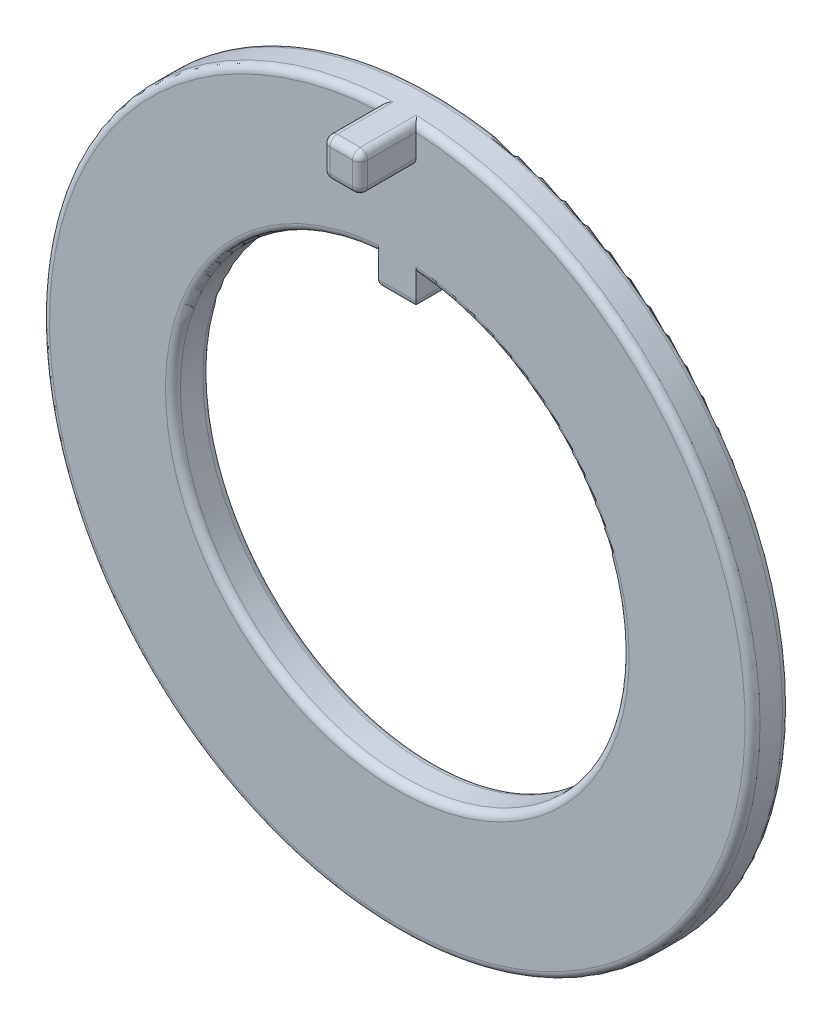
ISO-10303-21;
HEADER;
FILE_DESCRIPTION(('STEP AP214'),'2;1');
FILE_NAME('part.step','',(''),(''),'','','');
FILE_SCHEMA(('AUTOMOTIVE_DESIGN { 1 0 10303 214 1 1 1 1 }'));
ENDSEC;
DATA;
#1=APPLICATION_CONTEXT('core data for automotive mechanical design processes');
#2=APPLICATION_PROTOCOL_DEFINITION('international standard','automotive_design',2000,#1);
#3=PRODUCT_CONTEXT('',#1,'mechanical');
#4=PRODUCT('Part','Part','',(#3));
#5=PRODUCT_RELATED_PRODUCT_CATEGORY('part','',(#4));
#6=PRODUCT_DEFINITION_FORMATION('','',#4);
#7=PRODUCT_DEFINITION_CONTEXT('part definition',#1,'design');
#8=PRODUCT_DEFINITION('design','',#6,#7);
#9=PRODUCT_DEFINITION_SHAPE('','',#8);
#10=(LENGTH_UNIT() NAMED_UNIT(*) SI_UNIT(.MILLI.,.METRE.));
#11=(NAMED_UNIT(*) PLANE_ANGLE_UNIT() SI_UNIT($,.RADIAN.));
#12=(NAMED_UNIT(*) SI_UNIT($,.STERADIAN.) SOLID_ANGLE_UNIT());
#13=UNCERTAINTY_MEASURE_WITH_UNIT(LENGTH_MEASURE(1.E-05),#10,'distance_accuracy_value','');
#14=(GEOMETRIC_REPRESENTATION_CONTEXT(3) GLOBAL_UNCERTAINTY_ASSIGNED_CONTEXT((#13)) GLOBAL_UNIT_ASSIGNED_CONTEXT((#10,
#11,#12)) REPRESENTATION_CONTEXT('',''));
#15=CARTESIAN_POINT('',(0.,0.,0.));
#16=DIRECTION('',(0.,0.,1.));
#17=DIRECTION('',(1.,0.,0.));
#18=AXIS2_PLACEMENT_3D('',#15,#16,#17);
#19=CARTESIAN_POINT('',(0.,0.,1.));
#20=DIRECTION('',(0.,0.,1.));
#21=DIRECTION('',(1.,0.,0.));
#22=AXIS2_PLACEMENT_3D('',#19,#20,#21);
#23=PLANE('',#22);
#24=DIRECTION('',(0.,1.,0.));
#25=VECTOR('',#24,1.);
#26=CARTESIAN_POINT('',(-0.5,5.9791303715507,1.));
#27=LINE('',#26,#25);
#28=CARTESIAN_POINT('',(-0.5,5.3791303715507,1.));
#29=VERTEX_POINT('',#28);
#30=CARTESIAN_POINT('',(-0.5,6.17980582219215,1.));
#31=VERTEX_POINT('',#30);
#32=EDGE_CURVE('E500',#29,#31,#27,.T.);
#33=ORIENTED_EDGE('',*,*,#32,.F.);
#34=DIRECTION('',(-1.,0.,0.));
#35=VECTOR('',#34,1.);
#36=CARTESIAN_POINT('',(0.,5.3791303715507,1.));
#37=LINE('',#36,#35);
#38=CARTESIAN_POINT('',(0.5,5.3791303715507,1.));
#39=VERTEX_POINT('',#38);
#40=EDGE_CURVE('E43',#29,#39,#37,.F.);
#41=ORIENTED_EDGE('',*,*,#40,.T.);
#42=DIRECTION('',(0.,-1.,0.));
#43=VECTOR('',#42,1.);
#44=CARTESIAN_POINT('',(0.5,5.1791303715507,1.));
#45=LINE('',#44,#43);
#46=CARTESIAN_POINT('',(0.5,6.17980582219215,1.));
#47=VERTEX_POINT('',#46);
#48=EDGE_CURVE('E174',#47,#39,#45,.T.);
#49=ORIENTED_EDGE('',*,*,#48,.F.);
#50=CARTESIAN_POINT('',(0.,0.,1.));
#51=DIRECTION('',(0.,0.,1.));
#52=DIRECTION('',(1.,0.,0.));
#53=AXIS2_PLACEMENT_3D('',#50,#51,#52);
#54=CIRCLE('',#53,6.2);
#55=EDGE_CURVE('E205',#47,#31,#54,.F.);
#56=ORIENTED_EDGE('',*,*,#55,.T.);
#57=EDGE_LOOP('',(#33,#41,#49,#56));
#58=FACE_BOUND('',#57,.T.);
#59=DIRECTION('',(0.,-1.,0.));
#60=VECTOR('',#59,1.);
#61=CARTESIAN_POINT('',(-0.500000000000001,9.48683298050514,1.));
#62=LINE('',#61,#60);
#63=CARTESIAN_POINT('',(-0.500000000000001,9.28654941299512,1.));
#64=VERTEX_POINT('',#63);
#65=CARTESIAN_POINT('',(-0.5,8.68683298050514,1.));
#66=VERTEX_POINT('',#65);
#67=EDGE_CURVE('E388',#64,#66,#62,.T.);
#68=ORIENTED_EDGE('',*,*,#67,.F.);
#69=CARTESIAN_POINT('',(0.,0.,1.));
#70=DIRECTION('',(0.,0.,1.));
#71=DIRECTION('',(1.,0.,0.));
#72=AXIS2_PLACEMENT_3D('',#69,#70,#71);
#73=CIRCLE('',#72,9.3);
#74=CARTESIAN_POINT('',(0.5,9.28654941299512,1.));
#75=VERTEX_POINT('',#74);
#76=EDGE_CURVE('E484',#64,#75,#73,.T.);
#77=ORIENTED_EDGE('',*,*,#76,.T.);
#78=DIRECTION('',(0.,1.,0.));
#79=VECTOR('',#78,1.);
#80=CARTESIAN_POINT('',(0.5,8.48683298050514,1.));
#81=LINE('',#80,#79);
#82=CARTESIAN_POINT('',(0.5,8.68683298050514,1.));
#83=VERTEX_POINT('',#82);
#84=EDGE_CURVE('E489',#83,#75,#81,.T.);
#85=ORIENTED_EDGE('',*,*,#84,.F.);
#86=CARTESIAN_POINT('',(0.3,8.68683298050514,1.));
#87=DIRECTION('',(0.,0.,1.));
#88=DIRECTION('',(1.,0.,0.));
#89=AXIS2_PLACEMENT_3D('',#86,#87,#88);
#90=CIRCLE('',#89,0.2);
#91=CARTESIAN_POINT('',(0.299999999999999,8.48683298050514,1.));
#92=VERTEX_POINT('',#91);
#93=EDGE_CURVE('E483',#83,#92,#90,.F.);
#94=ORIENTED_EDGE('',*,*,#93,.T.);
#95=DIRECTION('',(1.,0.,0.));
#96=VECTOR('',#95,1.);
#97=CARTESIAN_POINT('',(-0.5,8.48683298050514,1.));
#98=LINE('',#97,#96);
#99=CARTESIAN_POINT('',(-0.300000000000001,8.48683298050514,1.));
#100=VERTEX_POINT('',#99);
#101=EDGE_CURVE('E492',#100,#92,#98,.T.);
#102=ORIENTED_EDGE('',*,*,#101,.F.);
#103=CARTESIAN_POINT('',(-0.3,8.68683298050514,1.));
#104=DIRECTION('',(0.,0.,1.));
#105=DIRECTION('',(1.,0.,0.));
#106=AXIS2_PLACEMENT_3D('',#103,#104,#105);
#107=CIRCLE('',#106,0.2);
#108=EDGE_CURVE('E476',#100,#66,#107,.F.);
#109=ORIENTED_EDGE('',*,*,#108,.T.);
#110=EDGE_LOOP('',(#68,#77,#85,#94,#102,#109));
#111=FACE_BOUND('',#110,.T.);
#112=ADVANCED_FACE('F34',(#58,#111),#23,.T.);
#113=CARTESIAN_POINT('',(0.,0.,0.));
#114=DIRECTION('',(0.,0.,1.));
#115=DIRECTION('',(1.,0.,0.));
#116=AXIS2_PLACEMENT_3D('',#113,#114,#115);
#117=PLANE('',#116);
#118=CARTESIAN_POINT('',(0.,0.,0.));
#119=DIRECTION('',(0.,0.,1.));
#120=DIRECTION('',(1.,0.,0.));
#121=AXIS2_PLACEMENT_3D('',#118,#119,#120);
#122=CIRCLE('',#121,9.3);
#123=CARTESIAN_POINT('',(9.3,0.,0.));
#124=VERTEX_POINT('',#123);
#125=EDGE_CURVE('E191',#124,#124,#122,.F.);
#126=ORIENTED_EDGE('',*,*,#125,.T.);
#127=EDGE_LOOP('',(#126));
#128=FACE_BOUND('',#127,.T.);
#129=DIRECTION('',(0.,-1.,0.));
#130=VECTOR('',#129,1.);
#131=CARTESIAN_POINT('',(0.5,5.1791303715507,0.));
#132=LINE('',#131,#130);
#133=CARTESIAN_POINT('',(0.5,6.17980582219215,0.));
#134=VERTEX_POINT('',#133);
#135=CARTESIAN_POINT('',(0.5,5.3791303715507,0.));
#136=VERTEX_POINT('',#135);
#137=EDGE_CURVE('E175',#134,#136,#132,.T.);
#138=ORIENTED_EDGE('',*,*,#137,.T.);
#139=DIRECTION('',(-1.,0.,0.));
#140=VECTOR('',#139,1.);
#141=CARTESIAN_POINT('',(-0.5,5.3791303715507,0.));
#142=LINE('',#141,#140);
#143=CARTESIAN_POINT('',(-0.5,5.3791303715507,0.));
#144=VERTEX_POINT('',#143);
#145=EDGE_CURVE('E173',#136,#144,#142,.T.);
#146=ORIENTED_EDGE('',*,*,#145,.T.);
#147=DIRECTION('',(0.,1.,0.));
#148=VECTOR('',#147,1.);
#149=CARTESIAN_POINT('',(-0.5,5.9791303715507,0.));
#150=LINE('',#149,#148);
#151=CARTESIAN_POINT('',(-0.5,6.17980582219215,0.));
#152=VERTEX_POINT('',#151);
#153=EDGE_CURVE('E166',#144,#152,#150,.T.);
#154=ORIENTED_EDGE('',*,*,#153,.T.);
#155=CARTESIAN_POINT('',(0.,0.,0.));
#156=DIRECTION('',(0.,0.,1.));
#157=DIRECTION('',(1.,0.,0.));
#158=AXIS2_PLACEMENT_3D('',#155,#156,#157);
#159=CIRCLE('',#158,6.2);
#160=EDGE_CURVE('E171',#152,#134,#159,.T.);
#161=ORIENTED_EDGE('',*,*,#160,.T.);
#162=EDGE_LOOP('',(#138,#146,#154,#161));
#163=FACE_BOUND('',#162,.T.);
#164=ADVANCED_FACE('F169',(#128,#163),#117,.F.);
#165=CARTESIAN_POINT('',(0.,0.,1.));
#166=DIRECTION('',(0.,0.,-1.));
#167=DIRECTION('',(-1.,0.,0.));
#168=AXIS2_PLACEMENT_3D('',#165,#166,#167);
#169=CYLINDRICAL_SURFACE('',#168,9.5);
#170=CARTESIAN_POINT('',(0.,0.,0.2));
#171=DIRECTION('',(0.,0.,1.));
#172=DIRECTION('',(1.,0.,0.));
#173=AXIS2_PLACEMENT_3D('',#170,#171,#172);
#174=CIRCLE('',#173,9.5);
#175=CARTESIAN_POINT('',(9.5,0.,0.2));
#176=VERTEX_POINT('',#175);
#177=EDGE_CURVE('E202',#176,#176,#174,.T.);
#178=ORIENTED_EDGE('',*,*,#177,.T.);
#179=EDGE_LOOP('',(#178));
#180=FACE_BOUND('',#179,.T.);
#181=DIRECTION('',(0.,0.,-1.));
#182=VECTOR('',#181,1.);
#183=CARTESIAN_POINT('',(-0.306451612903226,9.49505594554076,1.));
#184=LINE('',#183,#182);
#185=CARTESIAN_POINT('',(-0.306451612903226,9.49505594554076,0.8));
#186=VERTEX_POINT('',#185);
#187=CARTESIAN_POINT('',(-0.306451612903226,9.49505594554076,2.3));
#188=VERTEX_POINT('',#187);
#189=EDGE_CURVE('E339',#186,#188,#184,.F.);
#190=ORIENTED_EDGE('',*,*,#189,.T.);
#191=CARTESIAN_POINT('',(0.,0.,2.3));
#192=DIRECTION('',(0.,0.,1.));
#193=DIRECTION('',(1.,0.,0.));
#194=AXIS2_PLACEMENT_3D('',#191,#192,#193);
#195=CIRCLE('',#194,9.5);
#196=CARTESIAN_POINT('',(0.306451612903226,9.49505594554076,2.3));
#197=VERTEX_POINT('',#196);
#198=EDGE_CURVE('E342',#188,#197,#195,.F.);
#199=ORIENTED_EDGE('',*,*,#198,.T.);
#200=DIRECTION('',(0.,0.,-1.));
#201=VECTOR('',#200,1.);
#202=CARTESIAN_POINT('',(0.306451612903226,9.49505594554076,1.));
#203=LINE('',#202,#201);
#204=CARTESIAN_POINT('',(0.306451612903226,9.49505594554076,0.8));
#205=VERTEX_POINT('',#204);
#206=EDGE_CURVE('E347',#197,#205,#203,.T.);
#207=ORIENTED_EDGE('',*,*,#206,.T.);
#208=CARTESIAN_POINT('',(0.,0.,0.8));
#209=DIRECTION('',(0.,0.,1.));
#210=DIRECTION('',(1.,0.,0.));
#211=AXIS2_PLACEMENT_3D('',#208,#209,#210);
#212=CIRCLE('',#211,9.5);
#213=EDGE_CURVE('E299',#205,#186,#212,.F.);
#214=ORIENTED_EDGE('',*,*,#213,.T.);
#215=EDGE_LOOP('',(#190,#199,#207,#214));
#216=FACE_BOUND('',#215,.T.);
#217=ADVANCED_FACE('F325',(#180,#216),#169,.T.);
#218=CARTESIAN_POINT('',(0.,0.,1.));
#219=DIRECTION('',(0.,0.,-1.));
#220=DIRECTION('',(-1.,0.,0.));
#221=AXIS2_PLACEMENT_3D('',#218,#219,#220);
#222=CYLINDRICAL_SURFACE('',#221,6.);
#223=DIRECTION('',(0.,0.,-1.));
#224=VECTOR('',#223,1.);
#225=CARTESIAN_POINT('',(0.5,5.9791303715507,1.));
#226=LINE('',#225,#224);
#227=CARTESIAN_POINT('',(0.5,5.9791303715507,0.8));
#228=VERTEX_POINT('',#227);
#229=CARTESIAN_POINT('',(0.5,5.9791303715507,0.2));
#230=VERTEX_POINT('',#229);
#231=EDGE_CURVE('E197',#228,#230,#226,.T.);
#232=ORIENTED_EDGE('',*,*,#231,.T.);
#233=CARTESIAN_POINT('',(0.,0.,0.2));
#234=DIRECTION('',(0.,0.,1.));
#235=DIRECTION('',(1.,0.,0.));
#236=AXIS2_PLACEMENT_3D('',#233,#234,#235);
#237=CIRCLE('',#236,6.);
#238=CARTESIAN_POINT('',(-0.5,5.9791303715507,0.2));
#239=VERTEX_POINT('',#238);
#240=EDGE_CURVE('E194',#230,#239,#237,.F.);
#241=ORIENTED_EDGE('',*,*,#240,.T.);
#242=DIRECTION('',(0.,0.,-1.));
#243=VECTOR('',#242,1.);
#244=CARTESIAN_POINT('',(-0.5,5.9791303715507,1.));
#245=LINE('',#244,#243);
#246=CARTESIAN_POINT('',(-0.5,5.9791303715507,0.8));
#247=VERTEX_POINT('',#246);
#248=EDGE_CURVE('E182',#247,#239,#245,.T.);
#249=ORIENTED_EDGE('',*,*,#248,.F.);
#250=CARTESIAN_POINT('',(0.,0.,0.8));
#251=DIRECTION('',(0.,0.,1.));
#252=DIRECTION('',(1.,0.,0.));
#253=AXIS2_PLACEMENT_3D('',#250,#251,#252);
#254=CIRCLE('',#253,6.);
#255=EDGE_CURVE('E190',#247,#228,#254,.T.);
#256=ORIENTED_EDGE('',*,*,#255,.T.);
#257=EDGE_LOOP('',(#232,#241,#249,#256));
#258=FACE_BOUND('',#257,.T.);
#259=ADVANCED_FACE('F227',(#258),#222,.F.);
#260=CARTESIAN_POINT('',(0.5,5.1791303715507,1.));
#261=DIRECTION('',(1.,0.,0.));
#262=DIRECTION('',(0.,0.,-1.));
#263=AXIS2_PLACEMENT_3D('',#260,#261,#262);
#264=PLANE('',#263);
#265=ORIENTED_EDGE('',*,*,#48,.T.);
#266=DIRECTION('',(0.,0.,-1.));
#267=VECTOR('',#266,1.);
#268=CARTESIAN_POINT('',(0.5,5.3791303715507,1.));
#269=LINE('',#268,#267);
#270=EDGE_CURVE('E11',#39,#136,#269,.T.);
#271=ORIENTED_EDGE('',*,*,#270,.T.);
#272=ORIENTED_EDGE('',*,*,#137,.F.);
#273=CARTESIAN_POINT('',(0.5,6.17980582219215,0.));
#274=CARTESIAN_POINT('',(0.5,6.16848900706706,-9.42369699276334E-06));
#275=CARTESIAN_POINT('',(0.5,6.15717486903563,0.000953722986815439));
#276=CARTESIAN_POINT('',(0.5,6.13487391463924,0.00475563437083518));
#277=CARTESIAN_POINT('',(0.5,6.12388687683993,0.00759309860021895));
#278=CARTESIAN_POINT('',(0.5,6.10254011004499,0.0150761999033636));
#279=CARTESIAN_POINT('',(0.5,6.09218070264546,0.0197227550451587));
#280=CARTESIAN_POINT('',(0.5,6.07239231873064,0.0306899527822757));
#281=CARTESIAN_POINT('',(0.5,6.062963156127,0.037010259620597));
#282=CARTESIAN_POINT('',(0.5,6.04531581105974,0.0511385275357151));
#283=CARTESIAN_POINT('',(0.5,6.0370959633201,0.0589444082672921));
#284=CARTESIAN_POINT('',(0.5,6.02208679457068,0.0758311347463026));
#285=CARTESIAN_POINT('',(0.5,6.01529774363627,0.0849122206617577));
#286=CARTESIAN_POINT('',(0.5,6.00336713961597,0.104060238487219));
#287=CARTESIAN_POINT('',(0.5,5.99822075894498,0.11412416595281));
#288=CARTESIAN_POINT('',(0.5,5.98969950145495,0.134972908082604));
#289=CARTESIAN_POINT('',(0.5,5.98632349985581,0.145757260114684));
#290=CARTESIAN_POINT('',(0.5,5.98230220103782,0.163842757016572));
#291=CARTESIAN_POINT('',(0.5,5.98111348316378,0.171027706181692));
#292=CARTESIAN_POINT('',(0.5,5.97952769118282,0.185474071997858));
#293=CARTESIAN_POINT('',(0.5,5.97912949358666,0.192735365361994));
#294=CARTESIAN_POINT('',(0.5,5.97913037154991,0.199999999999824));
#295=B_SPLINE_CURVE_WITH_KNOTS('',3,(#273,#274,#275,#276,#277,#278,#279,#280,#281,#282,#283,
#284,#285,#286,#287,#288,#289,#290,#291,#292,#293,#294),.UNSPECIFIED.,.F.,.F.,(4,2,2,2,2,2,2,2,
2,2,4),(0.,0.0339057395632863,0.0677879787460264,0.101687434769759,0.135580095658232,
0.169425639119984,0.203277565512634,0.237029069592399,0.270759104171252,0.292566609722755,
0.314343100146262),.UNSPECIFIED.);
#296=EDGE_CURVE('E186',#134,#230,#295,.T.);
#297=ORIENTED_EDGE('',*,*,#296,.T.);
#298=ORIENTED_EDGE('',*,*,#231,.F.);
#299=CARTESIAN_POINT('',(0.5,5.9791303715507,0.8));
#300=CARTESIAN_POINT('',(0.5,5.97912064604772,0.811223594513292));
#301=CARTESIAN_POINT('',(0.5,5.9800778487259,0.82244409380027));
#302=CARTESIAN_POINT('',(0.5,5.983854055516,0.844557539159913));
#303=CARTESIAN_POINT('',(0.5,5.98667140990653,0.855450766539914));
#304=CARTESIAN_POINT('',(0.5,5.99409775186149,0.876614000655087));
#305=CARTESIAN_POINT('',(0.5,5.99870753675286,0.886883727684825));
#306=CARTESIAN_POINT('',(0.5,6.0095818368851,0.906503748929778));
#307=CARTESIAN_POINT('',(0.5,6.01584610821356,0.915854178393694));
#308=CARTESIAN_POINT('',(0.5,6.02986187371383,0.933388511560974));
#309=CARTESIAN_POINT('',(0.5,6.03761566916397,0.941570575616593));
#310=CARTESIAN_POINT('',(0.5,6.05438456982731,0.95652360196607));
#311=CARTESIAN_POINT('',(0.5,6.06339993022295,0.963294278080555));
#312=CARTESIAN_POINT('',(0.5,6.08246698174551,0.975254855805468));
#313=CARTESIAN_POINT('',(0.5,6.09252214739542,0.980439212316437));
#314=CARTESIAN_POINT('',(0.5,6.11335653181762,0.989049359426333));
#315=CARTESIAN_POINT('',(0.5,6.1241353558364,0.992476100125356));
#316=CARTESIAN_POINT('',(0.5,6.14244794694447,0.996646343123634));
#317=CARTESIAN_POINT('',(0.5,6.14986893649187,0.997903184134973));
#318=CARTESIAN_POINT('',(0.5,6.16479421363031,0.999579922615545));
#319=CARTESIAN_POINT('',(0.5,6.17229836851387,1.00000100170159));
#320=CARTESIAN_POINT('',(0.5,6.1798058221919,1.00000000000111));
#321=B_SPLINE_CURVE_WITH_KNOTS('',3,(#299,#300,#301,#302,#303,#304,#305,#306,#307,#308,#309,
#310,#311,#312,#313,#314,#315,#316,#317,#318,#319,#320),.UNSPECIFIED.,.F.,.F.,(4,2,2,2,2,2,2,2,
2,2,4),(0.,0.0336255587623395,0.0672213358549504,0.100832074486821,0.134437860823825,
0.168095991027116,0.201760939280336,0.23554225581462,0.269305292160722,0.291841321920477,
0.314345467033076),.UNSPECIFIED.);
#322=EDGE_CURVE('E185',#228,#47,#321,.T.);
#323=ORIENTED_EDGE('',*,*,#322,.T.);
#324=EDGE_LOOP('',(#265,#271,#272,#297,#298,#323));
#325=FACE_BOUND('',#324,.T.);
#326=ADVANCED_FACE('F221',(#325),#264,.T.);
#327=CARTESIAN_POINT('',(-0.5,5.1791303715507,1.));
#328=DIRECTION('',(0.,-1.,0.));
#329=DIRECTION('',(0.,0.,-1.));
#330=AXIS2_PLACEMENT_3D('',#327,#328,#329);
#331=PLANE('',#330);
#332=DIRECTION('',(0.,0.,-1.));
#333=VECTOR('',#332,1.);
#334=CARTESIAN_POINT('',(-0.3,5.1791303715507,1.));
#335=LINE('',#334,#333);
#336=CARTESIAN_POINT('',(-0.3,5.1791303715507,0.8));
#337=VERTEX_POINT('',#336);
#338=CARTESIAN_POINT('',(-0.3,5.1791303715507,0.2));
#339=VERTEX_POINT('',#338);
#340=EDGE_CURVE('E393',#337,#339,#335,.T.);
#341=ORIENTED_EDGE('',*,*,#340,.T.);
#342=DIRECTION('',(-1.,0.,0.));
#343=VECTOR('',#342,1.);
#344=CARTESIAN_POINT('',(0.5,5.1791303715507,0.2));
#345=LINE('',#344,#343);
#346=CARTESIAN_POINT('',(0.3,5.1791303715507,0.2));
#347=VERTEX_POINT('',#346);
#348=EDGE_CURVE('E395',#339,#347,#345,.F.);
#349=ORIENTED_EDGE('',*,*,#348,.T.);
#350=DIRECTION('',(0.,0.,-1.));
#351=VECTOR('',#350,1.);
#352=CARTESIAN_POINT('',(0.3,5.1791303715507,1.));
#353=LINE('',#352,#351);
#354=CARTESIAN_POINT('',(0.3,5.1791303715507,0.8));
#355=VERTEX_POINT('',#354);
#356=EDGE_CURVE('E369',#347,#355,#353,.F.);
#357=ORIENTED_EDGE('',*,*,#356,.T.);
#358=DIRECTION('',(-1.,0.,0.));
#359=VECTOR('',#358,1.);
#360=CARTESIAN_POINT('',(-0.5,5.1791303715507,0.8));
#361=LINE('',#360,#359);
#362=EDGE_CURVE('E391',#355,#337,#361,.T.);
#363=ORIENTED_EDGE('',*,*,#362,.T.);
#364=EDGE_LOOP('',(#341,#349,#357,#363));
#365=FACE_BOUND('',#364,.T.);
#366=ADVANCED_FACE('F226',(#365),#331,.T.);
#367=CARTESIAN_POINT('',(-0.5,5.9791303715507,1.));
#368=DIRECTION('',(-1.,0.,0.));
#369=DIRECTION('',(0.,-1.,0.));
#370=AXIS2_PLACEMENT_3D('',#367,#368,#369);
#371=PLANE('',#370);
#372=ORIENTED_EDGE('',*,*,#153,.F.);
#373=DIRECTION('',(0.,0.,-1.));
#374=VECTOR('',#373,1.);
#375=CARTESIAN_POINT('',(-0.5,5.3791303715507,1.));
#376=LINE('',#375,#374);
#377=EDGE_CURVE('E58',#144,#29,#376,.F.);
#378=ORIENTED_EDGE('',*,*,#377,.T.);
#379=ORIENTED_EDGE('',*,*,#32,.T.);
#380=CARTESIAN_POINT('',(-0.5,6.17980582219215,1.));
#381=CARTESIAN_POINT('',(-0.5,6.16848900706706,1.00000942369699));
#382=CARTESIAN_POINT('',(-0.5,6.15717486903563,0.999046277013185));
#383=CARTESIAN_POINT('',(-0.5,6.13487391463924,0.995244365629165));
#384=CARTESIAN_POINT('',(-0.5,6.12388687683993,0.992406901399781));
#385=CARTESIAN_POINT('',(-0.5,6.10254011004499,0.984923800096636));
#386=CARTESIAN_POINT('',(-0.5,6.09218070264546,0.980277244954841));
#387=CARTESIAN_POINT('',(-0.5,6.07239231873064,0.969310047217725));
#388=CARTESIAN_POINT('',(-0.5,6.062963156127,0.962989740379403));
#389=CARTESIAN_POINT('',(-0.5,6.04531581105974,0.948861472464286));
#390=CARTESIAN_POINT('',(-0.5,6.0370959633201,0.941055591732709));
#391=CARTESIAN_POINT('',(-0.5,6.02208679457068,0.924168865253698));
#392=CARTESIAN_POINT('',(-0.5,6.01529774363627,0.915087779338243));
#393=CARTESIAN_POINT('',(-0.5,6.00336713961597,0.895939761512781));
#394=CARTESIAN_POINT('',(-0.5,5.99822075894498,0.88587583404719));
#395=CARTESIAN_POINT('',(-0.5,5.98969950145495,0.865027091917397));
#396=CARTESIAN_POINT('',(-0.5,5.98632349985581,0.854242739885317));
#397=CARTESIAN_POINT('',(-0.5,5.98230220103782,0.836157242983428));
#398=CARTESIAN_POINT('',(-0.5,5.98111348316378,0.828972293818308));
#399=CARTESIAN_POINT('',(-0.5,5.97952769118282,0.814525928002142));
#400=CARTESIAN_POINT('',(-0.5,5.97912949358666,0.807264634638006));
#401=CARTESIAN_POINT('',(-0.5,5.97913037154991,0.800000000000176));
#402=B_SPLINE_CURVE_WITH_KNOTS('',3,(#380,#381,#382,#383,#384,#385,#386,#387,#388,#389,#390,
#391,#392,#393,#394,#395,#396,#397,#398,#399,#400,#401),.UNSPECIFIED.,.F.,.F.,(4,2,2,2,2,2,2,2,
2,2,4),(0.,0.0339057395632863,0.0677879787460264,0.101687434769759,0.135580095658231,
0.169425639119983,0.203277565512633,0.237029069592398,0.270759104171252,0.292566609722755,
0.314343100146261),.UNSPECIFIED.);
#403=EDGE_CURVE('E237',#31,#247,#402,.T.);
#404=ORIENTED_EDGE('',*,*,#403,.T.);
#405=ORIENTED_EDGE('',*,*,#248,.T.);
#406=CARTESIAN_POINT('',(-0.5,5.9791303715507,0.2));
#407=CARTESIAN_POINT('',(-0.5,5.97912064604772,0.188776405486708));
#408=CARTESIAN_POINT('',(-0.5,5.9800778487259,0.17755590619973));
#409=CARTESIAN_POINT('',(-0.5,5.983854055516,0.155442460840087));
#410=CARTESIAN_POINT('',(-0.5,5.98667140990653,0.144549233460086));
#411=CARTESIAN_POINT('',(-0.5,5.99409775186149,0.123385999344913));
#412=CARTESIAN_POINT('',(-0.5,5.99870753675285,0.113116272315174));
#413=CARTESIAN_POINT('',(-0.5,6.00958183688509,0.0934962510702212));
#414=CARTESIAN_POINT('',(-0.5,6.01584610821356,0.0841458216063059));
#415=CARTESIAN_POINT('',(-0.5,6.02986187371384,0.0666114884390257));
#416=CARTESIAN_POINT('',(-0.5,6.03761566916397,0.0584294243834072));
#417=CARTESIAN_POINT('',(-0.5,6.05438456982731,0.0434763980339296));
#418=CARTESIAN_POINT('',(-0.5,6.06339993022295,0.0367057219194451));
#419=CARTESIAN_POINT('',(-0.5,6.08246698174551,0.0247451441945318));
#420=CARTESIAN_POINT('',(-0.5,6.09252214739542,0.0195607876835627));
#421=CARTESIAN_POINT('',(-0.5,6.11335653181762,0.0109506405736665));
#422=CARTESIAN_POINT('',(-0.5,6.1241353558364,0.00752389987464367));
#423=CARTESIAN_POINT('',(-0.5,6.14244794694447,0.0033536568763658));
#424=CARTESIAN_POINT('',(-0.5,6.14986893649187,0.00209681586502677));
#425=CARTESIAN_POINT('',(-0.5,6.16479421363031,0.000420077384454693));
#426=CARTESIAN_POINT('',(-0.5,6.17229836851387,-1.00170159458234E-06));
#427=CARTESIAN_POINT('',(-0.5,6.1798058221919,-1.11282111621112E-12));
#428=B_SPLINE_CURVE_WITH_KNOTS('',3,(#406,#407,#408,#409,#410,#411,#412,#413,#414,#415,#416,
#417,#418,#419,#420,#421,#422,#423,#424,#425,#426,#427),.UNSPECIFIED.,.F.,.F.,(4,2,2,2,2,2,2,2,
2,2,4),(0.,0.0336255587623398,0.0672213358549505,0.100832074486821,0.134437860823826,
0.168095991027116,0.201760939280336,0.23554225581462,0.269305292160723,0.291841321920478,
0.314345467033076),.UNSPECIFIED.);
#429=EDGE_CURVE('E179',#239,#152,#428,.T.);
#430=ORIENTED_EDGE('',*,*,#429,.T.);
#431=EDGE_LOOP('',(#372,#378,#379,#404,#405,#430));
#432=FACE_BOUND('',#431,.T.);
#433=ADVANCED_FACE('F180',(#432),#371,.T.);
#434=CARTESIAN_POINT('',(0.,0.,0.2));
#435=DIRECTION('',(0.,0.,1.));
#436=DIRECTION('',(1.,0.,0.));
#437=AXIS2_PLACEMENT_3D('',#434,#435,#436);
#438=TOROIDAL_SURFACE('',#437,6.2,0.2);
#439=ORIENTED_EDGE('',*,*,#429,.F.);
#440=ORIENTED_EDGE('',*,*,#240,.F.);
#441=ORIENTED_EDGE('',*,*,#296,.F.);
#442=ORIENTED_EDGE('',*,*,#160,.F.);
#443=EDGE_LOOP('',(#439,#440,#441,#442));
#444=FACE_BOUND('',#443,.T.);
#445=ADVANCED_FACE('F189',(#444),#438,.T.);
#446=CARTESIAN_POINT('',(0.,0.,0.2));
#447=DIRECTION('',(0.,0.,1.));
#448=DIRECTION('',(1.,0.,0.));
#449=AXIS2_PLACEMENT_3D('',#446,#447,#448);
#450=TOROIDAL_SURFACE('',#449,9.3,0.2);
#451=ORIENTED_EDGE('',*,*,#125,.F.);
#452=EDGE_LOOP('',(#451));
#453=FACE_BOUND('',#452,.T.);
#454=ORIENTED_EDGE('',*,*,#177,.F.);
#455=EDGE_LOOP('',(#454));
#456=FACE_BOUND('',#455,.T.);
#457=ADVANCED_FACE('F247',(#453,#456),#450,.T.);
#458=CARTESIAN_POINT('',(0.,0.,0.8));
#459=DIRECTION('',(0.,0.,1.));
#460=DIRECTION('',(1.,0.,0.));
#461=AXIS2_PLACEMENT_3D('',#458,#459,#460);
#462=TOROIDAL_SURFACE('',#461,6.2,0.2);
#463=ORIENTED_EDGE('',*,*,#403,.F.);
#464=ORIENTED_EDGE('',*,*,#55,.F.);
#465=ORIENTED_EDGE('',*,*,#322,.F.);
#466=ORIENTED_EDGE('',*,*,#255,.F.);
#467=EDGE_LOOP('',(#463,#464,#465,#466));
#468=FACE_BOUND('',#467,.T.);
#469=ADVANCED_FACE('F242',(#468),#462,.T.);
#470=CARTESIAN_POINT('',(-0.500000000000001,9.48683298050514,2.5));
#471=DIRECTION('',(1.,0.,0.));
#472=DIRECTION('',(0.,1.,0.));
#473=AXIS2_PLACEMENT_3D('',#470,#471,#472);
#474=PLANE('',#473);
#475=DIRECTION('',(0.,0.,-1.));
#476=VECTOR('',#475,1.);
#477=CARTESIAN_POINT('',(-0.5,8.68683298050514,2.5));
#478=LINE('',#477,#476);
#479=CARTESIAN_POINT('',(-0.5,8.68683298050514,2.3));
#480=VERTEX_POINT('',#479);
#481=EDGE_CURVE('E507',#66,#480,#478,.F.);
#482=ORIENTED_EDGE('',*,*,#481,.T.);
#483=DIRECTION('',(0.,-1.,0.));
#484=VECTOR('',#483,1.);
#485=CARTESIAN_POINT('',(-0.500000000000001,9.2951600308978,2.3));
#486=LINE('',#485,#484);
#487=CARTESIAN_POINT('',(-0.500000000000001,9.2951600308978,2.3));
#488=VERTEX_POINT('',#487);
#489=EDGE_CURVE('E522',#480,#488,#486,.F.);
#490=ORIENTED_EDGE('',*,*,#489,.T.);
#491=DIRECTION('',(0.,0.,-1.));
#492=VECTOR('',#491,1.);
#493=CARTESIAN_POINT('',(-0.500000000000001,9.2951600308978,2.5));
#494=LINE('',#493,#492);
#495=CARTESIAN_POINT('',(-0.500000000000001,9.2951600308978,0.999815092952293));
#496=VERTEX_POINT('',#495);
#497=EDGE_CURVE('E509',#488,#496,#494,.T.);
#498=ORIENTED_EDGE('',*,*,#497,.T.);
#499=CARTESIAN_POINT('',(-0.500000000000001,9.2951600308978,0.999815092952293));
#500=CARTESIAN_POINT('',(-0.500000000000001,9.29372558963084,0.999876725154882));
#501=CARTESIAN_POINT('',(-0.500000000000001,9.29229081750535,0.99992295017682));
#502=CARTESIAN_POINT('',(-0.500000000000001,9.28942061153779,0.999984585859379));
#503=CARTESIAN_POINT('',(-0.500000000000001,9.28798517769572,0.999999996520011));
#504=CARTESIAN_POINT('',(-0.500000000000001,9.28654941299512,1.));
#505=B_SPLINE_CURVE_WITH_KNOTS('',3,(#499,#500,#501,#502,#503,#504),.UNSPECIFIED.,.F.,.F.,(4,2,
4),(0.,0.00430654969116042,0.00861309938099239),.UNSPECIFIED.);
#506=EDGE_CURVE('E267',#496,#64,#505,.T.);
#507=ORIENTED_EDGE('',*,*,#506,.T.);
#508=ORIENTED_EDGE('',*,*,#67,.T.);
#509=EDGE_LOOP('',(#482,#490,#498,#507,#508));
#510=FACE_BOUND('',#509,.T.);
#511=ADVANCED_FACE('F246',(#510),#474,.F.);
#512=CARTESIAN_POINT('',(-0.5,8.48683298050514,2.5));
#513=DIRECTION('',(0.,1.,0.));
#514=DIRECTION('',(-1.,0.,0.));
#515=AXIS2_PLACEMENT_3D('',#512,#513,#514);
#516=PLANE('',#515);
#517=DIRECTION('',(0.,0.,-1.));
#518=VECTOR('',#517,1.);
#519=CARTESIAN_POINT('',(0.299999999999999,8.48683298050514,2.5));
#520=LINE('',#519,#518);
#521=CARTESIAN_POINT('',(0.299999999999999,8.48683298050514,2.3));
#522=VERTEX_POINT('',#521);
#523=EDGE_CURVE('E346',#92,#522,#520,.F.);
#524=ORIENTED_EDGE('',*,*,#523,.T.);
#525=DIRECTION('',(1.,0.,0.));
#526=VECTOR('',#525,1.);
#527=CARTESIAN_POINT('',(-0.300000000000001,8.48683298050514,2.3));
#528=LINE('',#527,#526);
#529=CARTESIAN_POINT('',(-0.300000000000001,8.48683298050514,2.3));
#530=VERTEX_POINT('',#529);
#531=EDGE_CURVE('E371',#522,#530,#528,.F.);
#532=ORIENTED_EDGE('',*,*,#531,.T.);
#533=DIRECTION('',(0.,0.,-1.));
#534=VECTOR('',#533,1.);
#535=CARTESIAN_POINT('',(-0.300000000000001,8.48683298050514,2.5));
#536=LINE('',#535,#534);
#537=EDGE_CURVE('E474',#530,#100,#536,.T.);
#538=ORIENTED_EDGE('',*,*,#537,.T.);
#539=ORIENTED_EDGE('',*,*,#101,.T.);
#540=EDGE_LOOP('',(#524,#532,#538,#539));
#541=FACE_BOUND('',#540,.T.);
#542=ADVANCED_FACE('F306',(#541),#516,.F.);
#543=CARTESIAN_POINT('',(0.5,8.48683298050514,2.5));
#544=DIRECTION('',(-1.,0.,0.));
#545=DIRECTION('',(0.,-1.,0.));
#546=AXIS2_PLACEMENT_3D('',#543,#544,#545);
#547=PLANE('',#546);
#548=DIRECTION('',(0.,0.,-1.));
#549=VECTOR('',#548,1.);
#550=CARTESIAN_POINT('',(0.5,9.2951600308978,2.5));
#551=LINE('',#550,#549);
#552=CARTESIAN_POINT('',(0.5,9.2951600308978,0.999815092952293));
#553=VERTEX_POINT('',#552);
#554=CARTESIAN_POINT('',(0.5,9.2951600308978,2.3));
#555=VERTEX_POINT('',#554);
#556=EDGE_CURVE('E469',#553,#555,#551,.F.);
#557=ORIENTED_EDGE('',*,*,#556,.T.);
#558=DIRECTION('',(0.,1.,0.));
#559=VECTOR('',#558,1.);
#560=CARTESIAN_POINT('',(0.5,8.68683298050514,2.3));
#561=LINE('',#560,#559);
#562=CARTESIAN_POINT('',(0.5,8.68683298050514,2.3));
#563=VERTEX_POINT('',#562);
#564=EDGE_CURVE('E367',#555,#563,#561,.F.);
#565=ORIENTED_EDGE('',*,*,#564,.T.);
#566=DIRECTION('',(0.,0.,-1.));
#567=VECTOR('',#566,1.);
#568=CARTESIAN_POINT('',(0.5,8.68683298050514,2.5));
#569=LINE('',#568,#567);
#570=EDGE_CURVE('E473',#563,#83,#569,.T.);
#571=ORIENTED_EDGE('',*,*,#570,.T.);
#572=ORIENTED_EDGE('',*,*,#84,.T.);
#573=CARTESIAN_POINT('',(0.5,9.28654941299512,1.));
#574=CARTESIAN_POINT('',(0.5,9.28798517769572,0.999999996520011));
#575=CARTESIAN_POINT('',(0.5,9.28942061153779,0.999984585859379));
#576=CARTESIAN_POINT('',(0.5,9.29229081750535,0.99992295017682));
#577=CARTESIAN_POINT('',(0.5,9.29372558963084,0.999876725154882));
#578=CARTESIAN_POINT('',(0.5,9.2951600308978,0.999815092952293));
#579=B_SPLINE_CURVE_WITH_KNOTS('',3,(#573,#574,#575,#576,#577,#578),.UNSPECIFIED.,.F.,.F.,(4,2,
4),(0.,0.00430654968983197,0.00861309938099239),.UNSPECIFIED.);
#580=EDGE_CURVE('E291',#75,#553,#579,.T.);
#581=ORIENTED_EDGE('',*,*,#580,.T.);
#582=EDGE_LOOP('',(#557,#565,#571,#572,#581));
#583=FACE_BOUND('',#582,.T.);
#584=ADVANCED_FACE('F301',(#583),#547,.F.);
#585=CARTESIAN_POINT('',(0.,0.,2.5));
#586=DIRECTION('',(0.,0.,1.));
#587=DIRECTION('',(1.,0.,0.));
#588=AXIS2_PLACEMENT_3D('',#585,#586,#587);
#589=PLANE('',#588);
#590=CARTESIAN_POINT('',(0.,0.,2.5));
#591=DIRECTION('',(0.,0.,1.));
#592=DIRECTION('',(1.,0.,0.));
#593=AXIS2_PLACEMENT_3D('',#590,#591,#592);
#594=CIRCLE('',#593,9.3);
#595=CARTESIAN_POINT('',(0.3,9.2951600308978,2.5));
#596=VERTEX_POINT('',#595);
#597=CARTESIAN_POINT('',(-0.300000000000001,9.2951600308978,2.5));
#598=VERTEX_POINT('',#597);
#599=EDGE_CURVE('E527',#596,#598,#594,.T.);
#600=ORIENTED_EDGE('',*,*,#599,.T.);
#601=DIRECTION('',(0.,-1.,0.));
#602=VECTOR('',#601,1.);
#603=CARTESIAN_POINT('',(-0.3,8.68683298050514,2.5));
#604=LINE('',#603,#602);
#605=CARTESIAN_POINT('',(-0.3,8.68683298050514,2.5));
#606=VERTEX_POINT('',#605);
#607=EDGE_CURVE('E529',#598,#606,#604,.T.);
#608=ORIENTED_EDGE('',*,*,#607,.T.);
#609=DIRECTION('',(1.,0.,0.));
#610=VECTOR('',#609,1.);
#611=CARTESIAN_POINT('',(0.3,8.68683298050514,2.5));
#612=LINE('',#611,#610);
#613=CARTESIAN_POINT('',(0.3,8.68683298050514,2.5));
#614=VERTEX_POINT('',#613);
#615=EDGE_CURVE('E526',#606,#614,#612,.T.);
#616=ORIENTED_EDGE('',*,*,#615,.T.);
#617=DIRECTION('',(0.,1.,0.));
#618=VECTOR('',#617,1.);
#619=CARTESIAN_POINT('',(0.3,9.2951600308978,2.5));
#620=LINE('',#619,#618);
#621=EDGE_CURVE('E524',#614,#596,#620,.T.);
#622=ORIENTED_EDGE('',*,*,#621,.T.);
#623=EDGE_LOOP('',(#600,#608,#616,#622));
#624=FACE_BOUND('',#623,.T.);
#625=ADVANCED_FACE('F255',(#624),#589,.T.);
#626=CARTESIAN_POINT('',(-0.300000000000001,9.2951600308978,1.));
#627=DIRECTION('',(0.,0.,-1.));
#628=DIRECTION('',(-1.,0.,0.));
#629=AXIS2_PLACEMENT_3D('',#626,#627,#628);
#630=CYLINDRICAL_SURFACE('',#629,0.2);
#631=ORIENTED_EDGE('',*,*,#497,.F.);
#632=CARTESIAN_POINT('',(-0.300000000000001,9.2951600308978,2.3));
#633=DIRECTION('',(0.,0.,-1.));
#634=DIRECTION('',(-1.,0.,0.));
#635=AXIS2_PLACEMENT_3D('',#632,#633,#634);
#636=CIRCLE('',#635,0.2);
#637=EDGE_CURVE('E355',#488,#188,#636,.T.);
#638=ORIENTED_EDGE('',*,*,#637,.T.);
#639=ORIENTED_EDGE('',*,*,#189,.F.);
#640=CARTESIAN_POINT('',(-0.500000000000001,9.2951600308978,0.999815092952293));
#641=CARTESIAN_POINT('',(-0.500014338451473,9.3043991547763,0.999432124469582));
#642=CARTESIAN_POINT('',(-0.49936096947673,9.31357954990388,0.998386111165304));
#643=CARTESIAN_POINT('',(-0.496875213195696,9.33148468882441,0.995142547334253));
#644=CARTESIAN_POINT('',(-0.495053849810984,9.34021287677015,0.992955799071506));
#645=CARTESIAN_POINT('',(-0.490391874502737,9.357025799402,0.987602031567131));
#646=CARTESIAN_POINT('',(-0.487555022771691,9.36511277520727,0.984438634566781));
#647=CARTESIAN_POINT('',(-0.481037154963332,9.38057719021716,0.977310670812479));
#648=CARTESIAN_POINT('',(-0.477354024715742,9.38795278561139,0.973344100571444));
#649=CARTESIAN_POINT('',(-0.467499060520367,9.40507290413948,0.962850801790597));
#650=CARTESIAN_POINT('',(-0.460953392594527,9.41438860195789,0.955975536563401));
#651=CARTESIAN_POINT('',(-0.446850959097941,9.43138494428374,0.941306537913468));
#652=CARTESIAN_POINT('',(-0.439292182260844,9.4390622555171,0.933510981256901));
#653=CARTESIAN_POINT('',(-0.420518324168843,9.45541857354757,0.914274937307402));
#654=CARTESIAN_POINT('',(-0.408988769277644,9.46340861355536,0.902556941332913));
#655=CARTESIAN_POINT('',(-0.38512268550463,9.476655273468,0.878446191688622));
#656=CARTESIAN_POINT('',(-0.372785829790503,9.48191077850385,0.866053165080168));
#657=CARTESIAN_POINT('',(-0.351745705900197,9.48855437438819,0.845009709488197));
#658=CARTESIAN_POINT('',(-0.3431630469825,9.49064410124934,0.836450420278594));
#659=CARTESIAN_POINT('',(-0.325886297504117,9.49367112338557,0.81926342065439));
#660=CARTESIAN_POINT('',(-0.317192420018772,9.49461036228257,0.810635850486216));
#661=CARTESIAN_POINT('',(-0.307805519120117,9.49500880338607,0.801340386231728));
#662=CARTESIAN_POINT('',(-0.307128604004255,9.49503409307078,0.80067017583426));
#663=CARTESIAN_POINT('',(-0.306451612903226,9.49505594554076,0.8));
#664=B_SPLINE_CURVE_WITH_KNOTS('',3,(#640,#641,#642,#643,#644,#645,#646,#647,#648,#649,#650,
#651,#652,#653,#654,#655,#656,#657,#658,#659,#660,#661,#662,#663),.UNSPECIFIED.,.F.,.F.,(4,2,2,
2,2,2,2,2,2,2,2,4),(0.,0.0276485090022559,0.0550398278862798,0.0823307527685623,
0.109690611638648,0.149370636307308,0.189130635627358,0.243674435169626,0.298240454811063,
0.335091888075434,0.371880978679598,0.374739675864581),.UNSPECIFIED.);
#665=EDGE_CURVE('E259',#186,#496,#664,.F.);
#666=ORIENTED_EDGE('',*,*,#665,.T.);
#667=EDGE_LOOP('',(#631,#638,#639,#666));
#668=FACE_BOUND('',#667,.T.);
#669=ADVANCED_FACE('F249',(#668),#630,.T.);
#670=CARTESIAN_POINT('',(-0.3,8.68683298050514,2.5));
#671=DIRECTION('',(0.,0.,-1.));
#672=DIRECTION('',(-1.,0.,0.));
#673=AXIS2_PLACEMENT_3D('',#670,#671,#672);
#674=CYLINDRICAL_SURFACE('',#673,0.2);
#675=ORIENTED_EDGE('',*,*,#537,.F.);
#676=CARTESIAN_POINT('',(-0.3,8.68683298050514,2.3));
#677=DIRECTION('',(0.,0.,-1.));
#678=DIRECTION('',(-1.,0.,0.));
#679=AXIS2_PLACEMENT_3D('',#676,#677,#678);
#680=CIRCLE('',#679,0.2);
#681=EDGE_CURVE('E540',#530,#480,#680,.T.);
#682=ORIENTED_EDGE('',*,*,#681,.T.);
#683=ORIENTED_EDGE('',*,*,#481,.F.);
#684=ORIENTED_EDGE('',*,*,#108,.F.);
#685=EDGE_LOOP('',(#675,#682,#683,#684));
#686=FACE_BOUND('',#685,.T.);
#687=ADVANCED_FACE('F254',(#686),#674,.T.);
#688=CARTESIAN_POINT('',(0.3,8.68683298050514,2.5));
#689=DIRECTION('',(0.,0.,-1.));
#690=DIRECTION('',(-1.,0.,0.));
#691=AXIS2_PLACEMENT_3D('',#688,#689,#690);
#692=CYLINDRICAL_SURFACE('',#691,0.2);
#693=ORIENTED_EDGE('',*,*,#570,.F.);
#694=CARTESIAN_POINT('',(0.3,8.68683298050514,2.3));
#695=DIRECTION('',(0.,0.,-1.));
#696=DIRECTION('',(-1.,0.,0.));
#697=AXIS2_PLACEMENT_3D('',#694,#695,#696);
#698=CIRCLE('',#697,0.2);
#699=EDGE_CURVE('E470',#563,#522,#698,.T.);
#700=ORIENTED_EDGE('',*,*,#699,.T.);
#701=ORIENTED_EDGE('',*,*,#523,.F.);
#702=ORIENTED_EDGE('',*,*,#93,.F.);
#703=EDGE_LOOP('',(#693,#700,#701,#702));
#704=FACE_BOUND('',#703,.T.);
#705=ADVANCED_FACE('F544',(#704),#692,.T.);
#706=CARTESIAN_POINT('',(0.3,9.2951600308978,1.));
#707=DIRECTION('',(0.,0.,-1.));
#708=DIRECTION('',(-1.,0.,0.));
#709=AXIS2_PLACEMENT_3D('',#706,#707,#708);
#710=CYLINDRICAL_SURFACE('',#709,0.2);
#711=ORIENTED_EDGE('',*,*,#206,.F.);
#712=CARTESIAN_POINT('',(0.3,9.2951600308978,2.3));
#713=DIRECTION('',(0.,0.,-1.));
#714=DIRECTION('',(-1.,0.,0.));
#715=AXIS2_PLACEMENT_3D('',#712,#713,#714);
#716=CIRCLE('',#715,0.2);
#717=EDGE_CURVE('E462',#197,#555,#716,.T.);
#718=ORIENTED_EDGE('',*,*,#717,.T.);
#719=ORIENTED_EDGE('',*,*,#556,.F.);
#720=CARTESIAN_POINT('',(0.5,9.2951600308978,0.999815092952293));
#721=CARTESIAN_POINT('',(0.500014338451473,9.3043991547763,0.999432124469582));
#722=CARTESIAN_POINT('',(0.499360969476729,9.31357954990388,0.998386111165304));
#723=CARTESIAN_POINT('',(0.496875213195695,9.33148468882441,0.995142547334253));
#724=CARTESIAN_POINT('',(0.495053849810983,9.34021287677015,0.992955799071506));
#725=CARTESIAN_POINT('',(0.490391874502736,9.357025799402,0.987602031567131));
#726=CARTESIAN_POINT('',(0.48755502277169,9.36511277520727,0.984438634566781));
#727=CARTESIAN_POINT('',(0.481037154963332,9.38057719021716,0.977310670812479));
#728=CARTESIAN_POINT('',(0.477354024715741,9.38795278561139,0.973344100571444));
#729=CARTESIAN_POINT('',(0.467499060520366,9.40507290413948,0.962850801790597));
#730=CARTESIAN_POINT('',(0.460953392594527,9.41438860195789,0.955975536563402));
#731=CARTESIAN_POINT('',(0.446850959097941,9.43138494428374,0.94130653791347));
#732=CARTESIAN_POINT('',(0.439292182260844,9.43906225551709,0.933510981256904));
#733=CARTESIAN_POINT('',(0.420518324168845,9.45541857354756,0.914274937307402));
#734=CARTESIAN_POINT('',(0.408988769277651,9.46340861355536,0.902556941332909));
#735=CARTESIAN_POINT('',(0.385122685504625,9.476655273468,0.878446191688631));
#736=CARTESIAN_POINT('',(0.372785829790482,9.48191077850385,0.866053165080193));
#737=CARTESIAN_POINT('',(0.351745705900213,9.48855437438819,0.845009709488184));
#738=CARTESIAN_POINT('',(0.343163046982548,9.49064410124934,0.836450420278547));
#739=CARTESIAN_POINT('',(0.325886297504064,9.49367112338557,0.819263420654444));
#740=CARTESIAN_POINT('',(0.317192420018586,9.49461036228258,0.810635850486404));
#741=CARTESIAN_POINT('',(0.307805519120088,9.49500880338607,0.801340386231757));
#742=CARTESIAN_POINT('',(0.30712860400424,9.49503409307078,0.800670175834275));
#743=CARTESIAN_POINT('',(0.306451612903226,9.49505594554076,0.8));
#744=B_SPLINE_CURVE_WITH_KNOTS('',3,(#720,#721,#722,#723,#724,#725,#726,#727,#728,#729,#730,
#731,#732,#733,#734,#735,#736,#737,#738,#739,#740,#741,#742,#743),.UNSPECIFIED.,.F.,.F.,(4,2,2,
2,2,2,2,2,2,2,2,4),(0.,0.0276485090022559,0.0550398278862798,0.0823307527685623,
0.109690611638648,0.149370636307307,0.189130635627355,0.243674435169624,0.298240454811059,
0.335091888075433,0.371880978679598,0.374739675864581),.UNSPECIFIED.);
#745=EDGE_CURVE('E268',#553,#205,#744,.T.);
#746=ORIENTED_EDGE('',*,*,#745,.T.);
#747=EDGE_LOOP('',(#711,#718,#719,#746));
#748=FACE_BOUND('',#747,.T.);
#749=ADVANCED_FACE('F284',(#748),#710,.T.);
#750=CARTESIAN_POINT('',(0.,0.,0.8));
#751=DIRECTION('',(0.,0.,1.));
#752=DIRECTION('',(1.,0.,0.));
#753=AXIS2_PLACEMENT_3D('',#750,#751,#752);
#754=TOROIDAL_SURFACE('',#753,9.3,0.2);
#755=ORIENTED_EDGE('',*,*,#665,.F.);
#756=ORIENTED_EDGE('',*,*,#213,.F.);
#757=ORIENTED_EDGE('',*,*,#745,.F.);
#758=ORIENTED_EDGE('',*,*,#580,.F.);
#759=ORIENTED_EDGE('',*,*,#76,.F.);
#760=ORIENTED_EDGE('',*,*,#506,.F.);
#761=EDGE_LOOP('',(#755,#756,#757,#758,#759,#760));
#762=FACE_BOUND('',#761,.T.);
#763=ADVANCED_FACE('F279',(#762),#754,.T.);
#764=CARTESIAN_POINT('',(-0.3,8.68683298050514,2.3));
#765=DIRECTION('',(0.,0.,1.));
#766=DIRECTION('',(1.,0.,0.));
#767=AXIS2_PLACEMENT_3D('',#764,#765,#766);
#768=SPHERICAL_SURFACE('',#767,0.2);
#769=CARTESIAN_POINT('',(-0.3,8.68683298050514,2.3));
#770=DIRECTION('',(0.,1.,0.));
#771=DIRECTION('',(0.,0.,1.));
#772=AXIS2_PLACEMENT_3D('',#769,#770,#771);
#773=CIRCLE('',#772,0.2);
#774=EDGE_CURVE('E383',#480,#606,#773,.T.);
#775=ORIENTED_EDGE('',*,*,#774,.F.);
#776=ORIENTED_EDGE('',*,*,#681,.F.);
#777=CARTESIAN_POINT('',(-0.3,8.68683298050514,2.3));
#778=DIRECTION('',(1.,0.,0.));
#779=DIRECTION('',(0.,1.,0.));
#780=AXIS2_PLACEMENT_3D('',#777,#778,#779);
#781=CIRCLE('',#780,0.2);
#782=EDGE_CURVE('E386',#606,#530,#781,.T.);
#783=ORIENTED_EDGE('',*,*,#782,.F.);
#784=EDGE_LOOP('',(#775,#776,#783));
#785=FACE_BOUND('',#784,.T.);
#786=ADVANCED_FACE('F283',(#785),#768,.T.);
#787=CARTESIAN_POINT('',(0.,8.68683298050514,2.3));
#788=DIRECTION('',(-1.,0.,0.));
#789=DIRECTION('',(0.,-1.,0.));
#790=AXIS2_PLACEMENT_3D('',#787,#788,#789);
#791=CYLINDRICAL_SURFACE('',#790,0.2);
#792=ORIENTED_EDGE('',*,*,#782,.T.);
#793=ORIENTED_EDGE('',*,*,#531,.F.);
#794=CARTESIAN_POINT('',(0.3,8.68683298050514,2.3));
#795=DIRECTION('',(1.,0.,0.));
#796=DIRECTION('',(0.,1.,0.));
#797=AXIS2_PLACEMENT_3D('',#794,#795,#796);
#798=CIRCLE('',#797,0.2);
#799=EDGE_CURVE('E380',#614,#522,#798,.T.);
#800=ORIENTED_EDGE('',*,*,#799,.F.);
#801=ORIENTED_EDGE('',*,*,#615,.F.);
#802=EDGE_LOOP('',(#792,#793,#800,#801));
#803=FACE_BOUND('',#802,.T.);
#804=ADVANCED_FACE('F432',(#803),#791,.T.);
#805=CARTESIAN_POINT('',(-0.3,0.,2.3));
#806=DIRECTION('',(0.,1.,0.));
#807=DIRECTION('',(-1.,0.,0.));
#808=AXIS2_PLACEMENT_3D('',#805,#806,#807);
#809=CYLINDRICAL_SURFACE('',#808,0.2);
#810=ORIENTED_EDGE('',*,*,#774,.T.);
#811=ORIENTED_EDGE('',*,*,#607,.F.);
#812=CARTESIAN_POINT('',(-0.300000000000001,9.2951600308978,2.3));
#813=DIRECTION('',(0.,1.,0.));
#814=DIRECTION('',(0.,0.,1.));
#815=AXIS2_PLACEMENT_3D('',#812,#813,#814);
#816=CIRCLE('',#815,0.2);
#817=EDGE_CURVE('E357',#488,#598,#816,.T.);
#818=ORIENTED_EDGE('',*,*,#817,.F.);
#819=ORIENTED_EDGE('',*,*,#489,.F.);
#820=EDGE_LOOP('',(#810,#811,#818,#819));
#821=FACE_BOUND('',#820,.T.);
#822=ADVANCED_FACE('F436',(#821),#809,.T.);
#823=CARTESIAN_POINT('',(0.3,8.68683298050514,2.3));
#824=DIRECTION('',(0.,0.,1.));
#825=DIRECTION('',(1.,0.,0.));
#826=AXIS2_PLACEMENT_3D('',#823,#824,#825);
#827=SPHERICAL_SURFACE('',#826,0.2);
#828=ORIENTED_EDGE('',*,*,#799,.T.);
#829=ORIENTED_EDGE('',*,*,#699,.F.);
#830=CARTESIAN_POINT('',(0.3,8.68683298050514,2.3));
#831=DIRECTION('',(0.,1.,0.));
#832=DIRECTION('',(0.,0.,1.));
#833=AXIS2_PLACEMENT_3D('',#830,#831,#832);
#834=CIRCLE('',#833,0.2);
#835=EDGE_CURVE('E360',#614,#563,#834,.T.);
#836=ORIENTED_EDGE('',*,*,#835,.F.);
#837=EDGE_LOOP('',(#828,#829,#836));
#838=FACE_BOUND('',#837,.T.);
#839=ADVANCED_FACE('F440',(#838),#827,.T.);
#840=CARTESIAN_POINT('',(-0.300000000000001,9.2951600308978,2.3));
#841=DIRECTION('',(0.,0.,1.));
#842=DIRECTION('',(1.,0.,0.));
#843=AXIS2_PLACEMENT_3D('',#840,#841,#842);
#844=SPHERICAL_SURFACE('',#843,0.2);
#845=ORIENTED_EDGE('',*,*,#637,.F.);
#846=ORIENTED_EDGE('',*,*,#817,.T.);
#847=CARTESIAN_POINT('',(-0.300000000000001,9.2951600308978,2.3));
#848=DIRECTION('',(0.999479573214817,0.0322580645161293,0.));
#849=DIRECTION('',(-0.0322580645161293,0.999479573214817,0.));
#850=AXIS2_PLACEMENT_3D('',#847,#848,#849);
#851=CIRCLE('',#850,0.2);
#852=EDGE_CURVE('E353',#188,#598,#851,.T.);
#853=ORIENTED_EDGE('',*,*,#852,.F.);
#854=EDGE_LOOP('',(#845,#846,#853));
#855=FACE_BOUND('',#854,.T.);
#856=ADVANCED_FACE('F354',(#855),#844,.T.);
#857=CARTESIAN_POINT('',(0.299999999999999,0.,2.3));
#858=DIRECTION('',(0.,-1.,0.));
#859=DIRECTION('',(1.,0.,0.));
#860=AXIS2_PLACEMENT_3D('',#857,#858,#859);
#861=CYLINDRICAL_SURFACE('',#860,0.2);
#862=ORIENTED_EDGE('',*,*,#835,.T.);
#863=ORIENTED_EDGE('',*,*,#564,.F.);
#864=CARTESIAN_POINT('',(0.3,9.2951600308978,2.3));
#865=DIRECTION('',(0.,1.,0.));
#866=DIRECTION('',(0.,0.,1.));
#867=AXIS2_PLACEMENT_3D('',#864,#865,#866);
#868=CIRCLE('',#867,0.2);
#869=EDGE_CURVE('E361',#596,#555,#868,.T.);
#870=ORIENTED_EDGE('',*,*,#869,.F.);
#871=ORIENTED_EDGE('',*,*,#621,.F.);
#872=EDGE_LOOP('',(#862,#863,#870,#871));
#873=FACE_BOUND('',#872,.T.);
#874=ADVANCED_FACE('F447',(#873),#861,.T.);
#875=CARTESIAN_POINT('',(0.,0.,2.3));
#876=DIRECTION('',(0.,0.,1.));
#877=DIRECTION('',(1.,0.,0.));
#878=AXIS2_PLACEMENT_3D('',#875,#876,#877);
#879=TOROIDAL_SURFACE('',#878,9.3,0.2);
#880=ORIENTED_EDGE('',*,*,#852,.T.);
#881=ORIENTED_EDGE('',*,*,#599,.F.);
#882=CARTESIAN_POINT('',(0.3,9.2951600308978,2.3));
#883=DIRECTION('',(0.999479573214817,-0.032258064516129,0.));
#884=DIRECTION('',(0.032258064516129,0.999479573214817,0.));
#885=AXIS2_PLACEMENT_3D('',#882,#883,#884);
#886=CIRCLE('',#885,0.2);
#887=EDGE_CURVE('E366',#197,#596,#886,.T.);
#888=ORIENTED_EDGE('',*,*,#887,.F.);
#889=ORIENTED_EDGE('',*,*,#198,.F.);
#890=EDGE_LOOP('',(#880,#881,#888,#889));
#891=FACE_BOUND('',#890,.T.);
#892=ADVANCED_FACE('F364',(#891),#879,.T.);
#893=CARTESIAN_POINT('',(0.3,9.2951600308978,2.3));
#894=DIRECTION('',(0.,0.,1.));
#895=DIRECTION('',(1.,0.,0.));
#896=AXIS2_PLACEMENT_3D('',#893,#894,#895);
#897=SPHERICAL_SURFACE('',#896,0.2);
#898=ORIENTED_EDGE('',*,*,#869,.T.);
#899=ORIENTED_EDGE('',*,*,#717,.F.);
#900=ORIENTED_EDGE('',*,*,#887,.T.);
#901=EDGE_LOOP('',(#898,#899,#900));
#902=FACE_BOUND('',#901,.T.);
#903=ADVANCED_FACE('F287',(#902),#897,.T.);
#904=CARTESIAN_POINT('',(-0.5,5.3791303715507,0.8));
#905=DIRECTION('',(-1.,0.,0.));
#906=DIRECTION('',(0.,0.,1.));
#907=AXIS2_PLACEMENT_3D('',#904,#905,#906);
#908=CYLINDRICAL_SURFACE('',#907,0.2);
#909=CARTESIAN_POINT('',(-0.3,5.3791303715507,0.8));
#910=DIRECTION('',(-0.707106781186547,0.,-0.707106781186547));
#911=DIRECTION('',(-0.707106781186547,0.,0.707106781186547));
#912=AXIS2_PLACEMENT_3D('',#909,#910,#911);
#913=ELLIPSE('',#912,0.282842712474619,0.2);
#914=EDGE_CURVE('E403',#337,#29,#913,.T.);
#915=ORIENTED_EDGE('',*,*,#914,.F.);
#916=ORIENTED_EDGE('',*,*,#362,.F.);
#917=CARTESIAN_POINT('',(0.3,5.3791303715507,0.8));
#918=DIRECTION('',(0.707106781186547,0.,-0.707106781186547));
#919=DIRECTION('',(-0.707106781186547,0.,-0.707106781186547));
#920=AXIS2_PLACEMENT_3D('',#917,#918,#919);
#921=ELLIPSE('',#920,0.282842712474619,0.2);
#922=EDGE_CURVE('E38',#39,#355,#921,.T.);
#923=ORIENTED_EDGE('',*,*,#922,.F.);
#924=ORIENTED_EDGE('',*,*,#40,.F.);
#925=EDGE_LOOP('',(#915,#916,#923,#924));
#926=FACE_BOUND('',#925,.T.);
#927=ADVANCED_FACE('F36',(#926),#908,.T.);
#928=CARTESIAN_POINT('',(0.3,5.3791303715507,1.));
#929=DIRECTION('',(0.,0.,-1.));
#930=DIRECTION('',(-1.,0.,0.));
#931=AXIS2_PLACEMENT_3D('',#928,#929,#930);
#932=CYLINDRICAL_SURFACE('',#931,0.2);
#933=ORIENTED_EDGE('',*,*,#922,.T.);
#934=ORIENTED_EDGE('',*,*,#356,.F.);
#935=CARTESIAN_POINT('',(0.3,5.3791303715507,0.2));
#936=DIRECTION('',(-0.707106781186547,0.,-0.707106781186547));
#937=DIRECTION('',(0.707106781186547,0.,-0.707106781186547));
#938=AXIS2_PLACEMENT_3D('',#935,#936,#937);
#939=ELLIPSE('',#938,0.282842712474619,0.2);
#940=EDGE_CURVE('E402',#136,#347,#939,.T.);
#941=ORIENTED_EDGE('',*,*,#940,.F.);
#942=ORIENTED_EDGE('',*,*,#270,.F.);
#943=EDGE_LOOP('',(#933,#934,#941,#942));
#944=FACE_BOUND('',#943,.T.);
#945=ADVANCED_FACE('F413',(#944),#932,.T.);
#946=CARTESIAN_POINT('',(-0.3,5.3791303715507,1.));
#947=DIRECTION('',(0.,0.,-1.));
#948=DIRECTION('',(-1.,0.,0.));
#949=AXIS2_PLACEMENT_3D('',#946,#947,#948);
#950=CYLINDRICAL_SURFACE('',#949,0.2);
#951=ORIENTED_EDGE('',*,*,#914,.T.);
#952=ORIENTED_EDGE('',*,*,#377,.F.);
#953=CARTESIAN_POINT('',(-0.3,5.3791303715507,0.2));
#954=DIRECTION('',(0.707106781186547,0.,-0.707106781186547));
#955=DIRECTION('',(-0.707106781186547,0.,-0.707106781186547));
#956=AXIS2_PLACEMENT_3D('',#953,#954,#955);
#957=ELLIPSE('',#956,0.282842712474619,0.2);
#958=EDGE_CURVE('E400',#339,#144,#957,.T.);
#959=ORIENTED_EDGE('',*,*,#958,.F.);
#960=ORIENTED_EDGE('',*,*,#340,.F.);
#961=EDGE_LOOP('',(#951,#952,#959,#960));
#962=FACE_BOUND('',#961,.T.);
#963=ADVANCED_FACE('F421',(#962),#950,.T.);
#964=CARTESIAN_POINT('',(0.,5.3791303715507,0.2));
#965=DIRECTION('',(1.,0.,0.));
#966=DIRECTION('',(0.,0.,-1.));
#967=AXIS2_PLACEMENT_3D('',#964,#965,#966);
#968=CYLINDRICAL_SURFACE('',#967,0.2);
#969=ORIENTED_EDGE('',*,*,#940,.T.);
#970=ORIENTED_EDGE('',*,*,#348,.F.);
#971=ORIENTED_EDGE('',*,*,#958,.T.);
#972=ORIENTED_EDGE('',*,*,#145,.F.);
#973=EDGE_LOOP('',(#969,#970,#971,#972));
#974=FACE_BOUND('',#973,.T.);
#975=ADVANCED_FACE('F420',(#974),#968,.T.);
#976=CLOSED_SHELL('',(#112,#164,#217,#259,#326,#366,#433,#445,#457,#469,#511,#542,#584,#625,
#669,#687,#705,#749,#763,#786,#804,#822,#839,#856,#874,#892,#903,#927,#945,#963,#975));
#977=MANIFOLD_SOLID_BREP('B2',#976);
#978=ADVANCED_BREP_SHAPE_REPRESENTATION('',(#18,#977),#14);
#979=SHAPE_DEFINITION_REPRESENTATION(#9,#978);
ENDSEC;
END-ISO-10303-21;
